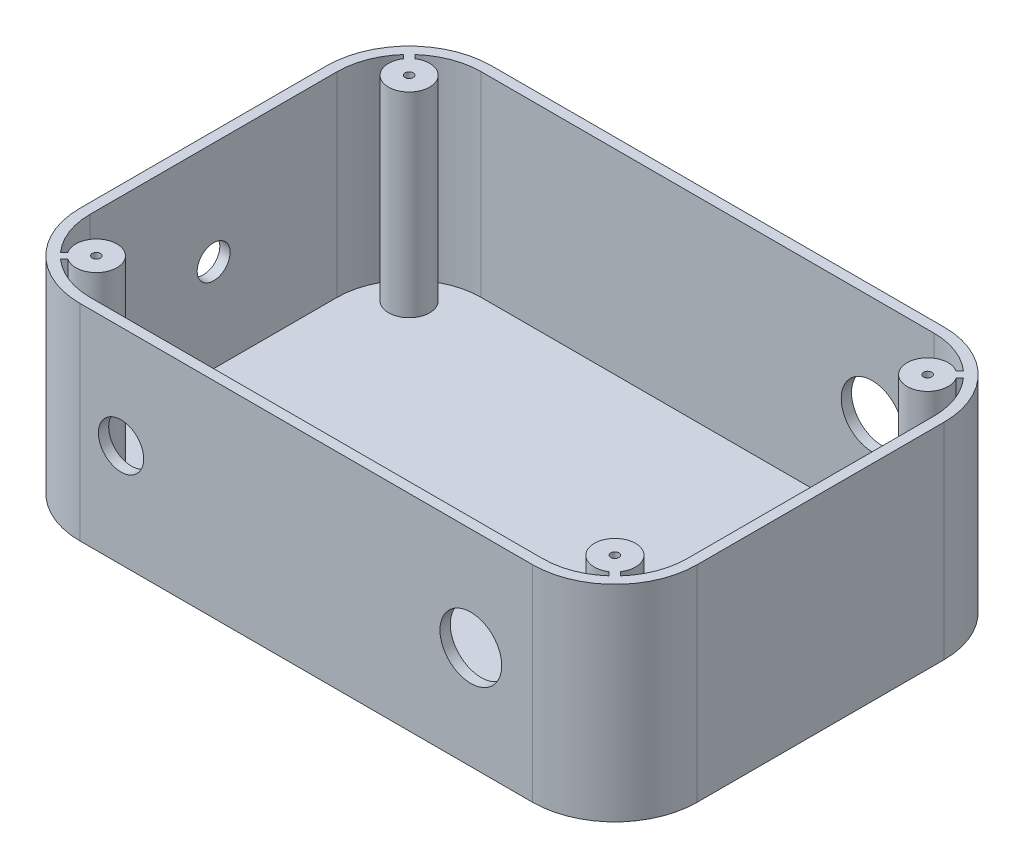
ISO-10303-21;
HEADER;
FILE_DESCRIPTION(('STEP AP214'),'2;1');
FILE_NAME('part.step','',(''),(''),'','','');
FILE_SCHEMA(('AUTOMOTIVE_DESIGN { 1 0 10303 214 1 1 1 1 }'));
ENDSEC;
DATA;
#1=APPLICATION_CONTEXT('core data for automotive mechanical design processes');
#2=APPLICATION_PROTOCOL_DEFINITION('international standard','automotive_design',2000,#1);
#3=PRODUCT_CONTEXT('',#1,'mechanical');
#4=PRODUCT('Part','Part','',(#3));
#5=PRODUCT_RELATED_PRODUCT_CATEGORY('part','',(#4));
#6=PRODUCT_DEFINITION_FORMATION('','',#4);
#7=PRODUCT_DEFINITION_CONTEXT('part definition',#1,'design');
#8=PRODUCT_DEFINITION('design','',#6,#7);
#9=PRODUCT_DEFINITION_SHAPE('','',#8);
#10=(LENGTH_UNIT() NAMED_UNIT(*) SI_UNIT(.MILLI.,.METRE.));
#11=(NAMED_UNIT(*) PLANE_ANGLE_UNIT() SI_UNIT($,.RADIAN.));
#12=(NAMED_UNIT(*) SI_UNIT($,.STERADIAN.) SOLID_ANGLE_UNIT());
#13=UNCERTAINTY_MEASURE_WITH_UNIT(LENGTH_MEASURE(1.E-05),#10,'distance_accuracy_value','');
#14=(GEOMETRIC_REPRESENTATION_CONTEXT(3) GLOBAL_UNCERTAINTY_ASSIGNED_CONTEXT((#13)) GLOBAL_UNIT_ASSIGNED_CONTEXT((#10,
#11,#12)) REPRESENTATION_CONTEXT('',''));
#15=CARTESIAN_POINT('',(0.,0.,0.));
#16=DIRECTION('',(0.,0.,1.));
#17=DIRECTION('',(1.,0.,0.));
#18=AXIS2_PLACEMENT_3D('',#15,#16,#17);
#19=CARTESIAN_POINT('',(55.,50.,30.));
#20=DIRECTION('',(0.,-1.,0.));
#21=DIRECTION('',(0.,0.,-1.));
#22=AXIS2_PLACEMENT_3D('',#19,#20,#21);
#23=CYLINDRICAL_SURFACE('',#22,17.5);
#24=DIRECTION('',(0.,-1.,0.));
#25=VECTOR('',#24,1.);
#26=CARTESIAN_POINT('',(66.6470423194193,50.,43.0612558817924));
#27=LINE('',#26,#25);
#28=CARTESIAN_POINT('',(66.6470423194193,2.5,43.0612558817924));
#29=VERTEX_POINT('',#28);
#30=CARTESIAN_POINT('',(66.6470423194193,50.,43.0612558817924));
#31=VERTEX_POINT('',#30);
#32=EDGE_CURVE('E44',#29,#31,#27,.F.);
#33=ORIENTED_EDGE('',*,*,#32,.F.);
#34=CARTESIAN_POINT('',(55.,2.5,30.));
#35=DIRECTION('',(0.,-1.,0.));
#36=DIRECTION('',(0.,0.,-1.));
#37=AXIS2_PLACEMENT_3D('',#34,#35,#36);
#38=CIRCLE('',#37,17.5);
#39=CARTESIAN_POINT('',(55.,2.5,47.5));
#40=VERTEX_POINT('',#39);
#41=EDGE_CURVE('E373',#29,#40,#38,.T.);
#42=ORIENTED_EDGE('',*,*,#41,.T.);
#43=DIRECTION('',(0.,1.,0.));
#44=VECTOR('',#43,1.);
#45=CARTESIAN_POINT('',(55.,50.,47.5));
#46=LINE('',#45,#44);
#47=CARTESIAN_POINT('',(55.,50.,47.5));
#48=VERTEX_POINT('',#47);
#49=EDGE_CURVE('E409',#40,#48,#46,.T.);
#50=ORIENTED_EDGE('',*,*,#49,.T.);
#51=CARTESIAN_POINT('',(55.,50.,30.));
#52=DIRECTION('',(0.,-1.,0.));
#53=DIRECTION('',(0.,0.,-1.));
#54=AXIS2_PLACEMENT_3D('',#51,#52,#53);
#55=CIRCLE('',#54,17.5);
#56=EDGE_CURVE('E404',#48,#31,#55,.F.);
#57=ORIENTED_EDGE('',*,*,#56,.T.);
#58=EDGE_LOOP('',(#33,#42,#50,#57));
#59=FACE_BOUND('',#58,.T.);
#60=ADVANCED_FACE('F35',(#59),#23,.F.);
#61=CARTESIAN_POINT('',(0.,2.5,0.));
#62=DIRECTION('',(0.,-1.,0.));
#63=DIRECTION('',(0.,0.,-1.));
#64=AXIS2_PLACEMENT_3D('',#61,#62,#63);
#65=PLANE('',#64);
#66=CARTESIAN_POINT('',(63.,2.5,38.));
#67=DIRECTION('',(0.,-1.,0.));
#68=DIRECTION('',(0.,0.,-1.));
#69=AXIS2_PLACEMENT_3D('',#66,#67,#68);
#70=CIRCLE('',#69,5.);
#71=CARTESIAN_POINT('',(67.1712083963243,2.5,40.7569948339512));
#72=VERTEX_POINT('',#71);
#73=CARTESIAN_POINT('',(65.7569948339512,2.5,42.1712083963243));
#74=VERTEX_POINT('',#73);
#75=EDGE_CURVE('E52',#72,#74,#70,.F.);
#76=ORIENTED_EDGE('',*,*,#75,.F.);
#77=DIRECTION('',(0.707106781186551,0.,0.707106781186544));
#78=VECTOR('',#77,1.);
#79=CARTESIAN_POINT('',(13.2071067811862,2.5,-13.2071067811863));
#80=LINE('',#79,#78);
#81=CARTESIAN_POINT('',(68.0612558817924,2.5,41.6470423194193));
#82=VERTEX_POINT('',#81);
#83=EDGE_CURVE('E273',#72,#82,#80,.T.);
#84=ORIENTED_EDGE('',*,*,#83,.T.);
#85=CARTESIAN_POINT('',(72.5,2.5,30.));
#86=VERTEX_POINT('',#85);
#87=EDGE_CURVE('E369',#86,#82,#38,.T.);
#88=ORIENTED_EDGE('',*,*,#87,.F.);
#89=DIRECTION('',(0.,0.,-1.));
#90=VECTOR('',#89,1.);
#91=CARTESIAN_POINT('',(72.5,2.5,0.));
#92=LINE('',#91,#90);
#93=CARTESIAN_POINT('',(72.5,2.5,-30.));
#94=VERTEX_POINT('',#93);
#95=EDGE_CURVE('E358',#86,#94,#92,.T.);
#96=ORIENTED_EDGE('',*,*,#95,.T.);
#97=CARTESIAN_POINT('',(55.,2.5,-30.));
#98=DIRECTION('',(0.,-1.,0.));
#99=DIRECTION('',(0.,0.,-1.));
#100=AXIS2_PLACEMENT_3D('',#97,#98,#99);
#101=CIRCLE('',#100,17.5);
#102=CARTESIAN_POINT('',(68.0612558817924,2.5,-41.6470423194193));
#103=VERTEX_POINT('',#102);
#104=EDGE_CURVE('E362',#103,#94,#101,.T.);
#105=ORIENTED_EDGE('',*,*,#104,.F.);
#106=DIRECTION('',(0.707106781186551,0.,-0.707106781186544));
#107=VECTOR('',#106,1.);
#108=CARTESIAN_POINT('',(13.2071067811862,2.5,13.2071067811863));
#109=LINE('',#108,#107);
#110=CARTESIAN_POINT('',(67.1712083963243,2.5,-40.7569948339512));
#111=VERTEX_POINT('',#110);
#112=EDGE_CURVE('E299',#111,#103,#109,.T.);
#113=ORIENTED_EDGE('',*,*,#112,.F.);
#114=CARTESIAN_POINT('',(63.,2.5,-38.));
#115=DIRECTION('',(0.,-1.,0.));
#116=DIRECTION('',(0.,0.,-1.));
#117=AXIS2_PLACEMENT_3D('',#114,#115,#116);
#118=CIRCLE('',#117,5.);
#119=CARTESIAN_POINT('',(65.7569948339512,2.5,-42.1712083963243));
#120=VERTEX_POINT('',#119);
#121=EDGE_CURVE('E302',#111,#120,#118,.T.);
#122=ORIENTED_EDGE('',*,*,#121,.T.);
#123=DIRECTION('',(0.707106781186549,0.,-0.707106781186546));
#124=VECTOR('',#123,1.);
#125=CARTESIAN_POINT('',(11.7928932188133,2.5,11.7928932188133));
#126=LINE('',#125,#124);
#127=CARTESIAN_POINT('',(66.6470423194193,2.5,-43.0612558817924));
#128=VERTEX_POINT('',#127);
#129=EDGE_CURVE('E295',#120,#128,#126,.T.);
#130=ORIENTED_EDGE('',*,*,#129,.T.);
#131=CARTESIAN_POINT('',(55.,2.5,-47.5));
#132=VERTEX_POINT('',#131);
#133=EDGE_CURVE('E391',#132,#128,#101,.T.);
#134=ORIENTED_EDGE('',*,*,#133,.F.);
#135=DIRECTION('',(-1.,0.,0.));
#136=VECTOR('',#135,1.);
#137=CARTESIAN_POINT('',(0.,2.5,-47.5));
#138=LINE('',#137,#136);
#139=CARTESIAN_POINT('',(-55.,2.5,-47.5));
#140=VERTEX_POINT('',#139);
#141=EDGE_CURVE('E366',#132,#140,#138,.T.);
#142=ORIENTED_EDGE('',*,*,#141,.T.);
#143=CARTESIAN_POINT('',(-55.,2.5,-30.));
#144=DIRECTION('',(0.,-1.,0.));
#145=DIRECTION('',(0.,0.,-1.));
#146=AXIS2_PLACEMENT_3D('',#143,#144,#145);
#147=CIRCLE('',#146,17.5);
#148=CARTESIAN_POINT('',(-66.6470423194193,2.5,-43.0612558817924));
#149=VERTEX_POINT('',#148);
#150=EDGE_CURVE('E388',#149,#140,#147,.T.);
#151=ORIENTED_EDGE('',*,*,#150,.F.);
#152=DIRECTION('',(-0.707106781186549,0.,-0.707106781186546));
#153=VECTOR('',#152,1.);
#154=CARTESIAN_POINT('',(-11.7928932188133,2.5,11.7928932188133));
#155=LINE('',#154,#153);
#156=CARTESIAN_POINT('',(-65.7569948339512,2.5,-42.1712083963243));
#157=VERTEX_POINT('',#156);
#158=EDGE_CURVE('E322',#157,#149,#155,.T.);
#159=ORIENTED_EDGE('',*,*,#158,.F.);
#160=CARTESIAN_POINT('',(-63.,2.5,-38.));
#161=DIRECTION('',(0.,-1.,0.));
#162=DIRECTION('',(0.,0.,-1.));
#163=AXIS2_PLACEMENT_3D('',#160,#161,#162);
#164=CIRCLE('',#163,5.);
#165=CARTESIAN_POINT('',(-67.1712083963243,2.5,-40.7569948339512));
#166=VERTEX_POINT('',#165);
#167=EDGE_CURVE('E329',#166,#157,#164,.F.);
#168=ORIENTED_EDGE('',*,*,#167,.F.);
#169=DIRECTION('',(-0.707106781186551,0.,-0.707106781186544));
#170=VECTOR('',#169,1.);
#171=CARTESIAN_POINT('',(-13.2071067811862,2.5,13.2071067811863));
#172=LINE('',#171,#170);
#173=CARTESIAN_POINT('',(-68.0612558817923,2.5,-41.6470423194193));
#174=VERTEX_POINT('',#173);
#175=EDGE_CURVE('E327',#166,#174,#172,.T.);
#176=ORIENTED_EDGE('',*,*,#175,.T.);
#177=CARTESIAN_POINT('',(-72.5,2.5,-30.));
#178=VERTEX_POINT('',#177);
#179=EDGE_CURVE('E385',#178,#174,#147,.T.);
#180=ORIENTED_EDGE('',*,*,#179,.F.);
#181=DIRECTION('',(0.,0.,1.));
#182=VECTOR('',#181,1.);
#183=CARTESIAN_POINT('',(-72.5,2.5,0.));
#184=LINE('',#183,#182);
#185=CARTESIAN_POINT('',(-72.5,2.5,30.));
#186=VERTEX_POINT('',#185);
#187=EDGE_CURVE('E378',#178,#186,#184,.T.);
#188=ORIENTED_EDGE('',*,*,#187,.T.);
#189=CARTESIAN_POINT('',(-55.,2.5,30.));
#190=DIRECTION('',(0.,-1.,0.));
#191=DIRECTION('',(0.,0.,-1.));
#192=AXIS2_PLACEMENT_3D('',#189,#190,#191);
#193=CIRCLE('',#192,17.5);
#194=CARTESIAN_POINT('',(-68.0612558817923,2.5,41.6470423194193));
#195=VERTEX_POINT('',#194);
#196=EDGE_CURVE('E382',#195,#186,#193,.T.);
#197=ORIENTED_EDGE('',*,*,#196,.F.);
#198=DIRECTION('',(-0.707106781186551,0.,0.707106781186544));
#199=VECTOR('',#198,1.);
#200=CARTESIAN_POINT('',(-13.2071067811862,2.5,-13.2071067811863));
#201=LINE('',#200,#199);
#202=CARTESIAN_POINT('',(-67.1712083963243,2.5,40.7569948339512));
#203=VERTEX_POINT('',#202);
#204=EDGE_CURVE('E355',#203,#195,#201,.T.);
#205=ORIENTED_EDGE('',*,*,#204,.F.);
#206=CARTESIAN_POINT('',(-63.,2.5,38.));
#207=DIRECTION('',(0.,-1.,0.));
#208=DIRECTION('',(0.,0.,-1.));
#209=AXIS2_PLACEMENT_3D('',#206,#207,#208);
#210=CIRCLE('',#209,5.);
#211=CARTESIAN_POINT('',(-65.7569948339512,2.5,42.1712083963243));
#212=VERTEX_POINT('',#211);
#213=EDGE_CURVE('E496',#203,#212,#210,.T.);
#214=ORIENTED_EDGE('',*,*,#213,.T.);
#215=DIRECTION('',(-0.707106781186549,0.,0.707106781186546));
#216=VECTOR('',#215,1.);
#217=CARTESIAN_POINT('',(-11.7928932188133,2.5,-11.7928932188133));
#218=LINE('',#217,#216);
#219=CARTESIAN_POINT('',(-66.6470423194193,2.5,43.0612558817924));
#220=VERTEX_POINT('',#219);
#221=EDGE_CURVE('E351',#212,#220,#218,.T.);
#222=ORIENTED_EDGE('',*,*,#221,.T.);
#223=CARTESIAN_POINT('',(-55.,2.5,47.5));
#224=VERTEX_POINT('',#223);
#225=EDGE_CURVE('E379',#224,#220,#193,.T.);
#226=ORIENTED_EDGE('',*,*,#225,.F.);
#227=DIRECTION('',(1.,0.,0.));
#228=VECTOR('',#227,1.);
#229=CARTESIAN_POINT('',(0.,2.5,47.5));
#230=LINE('',#229,#228);
#231=EDGE_CURVE('E374',#224,#40,#230,.T.);
#232=ORIENTED_EDGE('',*,*,#231,.T.);
#233=ORIENTED_EDGE('',*,*,#41,.F.);
#234=DIRECTION('',(0.707106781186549,0.,0.707106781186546));
#235=VECTOR('',#234,1.);
#236=CARTESIAN_POINT('',(11.7928932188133,2.5,-11.7928932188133));
#237=LINE('',#236,#235);
#238=EDGE_CURVE('E57',#74,#29,#237,.T.);
#239=ORIENTED_EDGE('',*,*,#238,.F.);
#240=EDGE_LOOP('',(#76,#84,#88,#96,#105,#113,#122,#130,#134,#142,#151,#159,#168,#176,#180,#188,
#197,#205,#214,#222,#226,#232,#233,#239));
#241=FACE_BOUND('',#240,.T.);
#242=ADVANCED_FACE('F558',(#241),#65,.F.);
#243=CARTESIAN_POINT('',(55.,50.,-30.));
#244=DIRECTION('',(0.,-1.,0.));
#245=DIRECTION('',(0.,0.,-1.));
#246=AXIS2_PLACEMENT_3D('',#243,#244,#245);
#247=CYLINDRICAL_SURFACE('',#246,17.5);
#248=DIRECTION('',(0.,-1.,0.));
#249=VECTOR('',#248,1.);
#250=CARTESIAN_POINT('',(68.0612558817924,50.,-41.6470423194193));
#251=LINE('',#250,#249);
#252=CARTESIAN_POINT('',(68.0612558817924,50.,-41.6470423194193));
#253=VERTEX_POINT('',#252);
#254=EDGE_CURVE('E507',#103,#253,#251,.F.);
#255=ORIENTED_EDGE('',*,*,#254,.F.);
#256=ORIENTED_EDGE('',*,*,#104,.T.);
#257=DIRECTION('',(0.,1.,0.));
#258=VECTOR('',#257,1.);
#259=CARTESIAN_POINT('',(72.5,50.,-30.));
#260=LINE('',#259,#258);
#261=CARTESIAN_POINT('',(72.5,50.,-30.));
#262=VERTEX_POINT('',#261);
#263=EDGE_CURVE('E363',#94,#262,#260,.T.);
#264=ORIENTED_EDGE('',*,*,#263,.T.);
#265=CARTESIAN_POINT('',(55.,50.,-30.));
#266=DIRECTION('',(0.,-1.,0.));
#267=DIRECTION('',(0.,0.,-1.));
#268=AXIS2_PLACEMENT_3D('',#265,#266,#267);
#269=CIRCLE('',#268,17.5);
#270=EDGE_CURVE('E415',#262,#253,#269,.F.);
#271=ORIENTED_EDGE('',*,*,#270,.T.);
#272=EDGE_LOOP('',(#255,#256,#264,#271));
#273=FACE_BOUND('',#272,.T.);
#274=ADVANCED_FACE('F565',(#273),#247,.F.);
#275=CARTESIAN_POINT('',(-55.,50.,-30.));
#276=DIRECTION('',(0.,-1.,0.));
#277=DIRECTION('',(0.,0.,-1.));
#278=AXIS2_PLACEMENT_3D('',#275,#276,#277);
#279=CYLINDRICAL_SURFACE('',#278,17.5);
#280=DIRECTION('',(0.,-1.,0.));
#281=VECTOR('',#280,1.);
#282=CARTESIAN_POINT('',(-66.6470423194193,50.,-43.0612558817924));
#283=LINE('',#282,#281);
#284=CARTESIAN_POINT('',(-66.6470423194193,50.,-43.0612558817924));
#285=VERTEX_POINT('',#284);
#286=EDGE_CURVE('E498',#149,#285,#283,.F.);
#287=ORIENTED_EDGE('',*,*,#286,.F.);
#288=ORIENTED_EDGE('',*,*,#150,.T.);
#289=DIRECTION('',(0.,1.,0.));
#290=VECTOR('',#289,1.);
#291=CARTESIAN_POINT('',(-55.,50.,-47.5));
#292=LINE('',#291,#290);
#293=CARTESIAN_POINT('',(-55.,50.,-47.5));
#294=VERTEX_POINT('',#293);
#295=EDGE_CURVE('E394',#140,#294,#292,.T.);
#296=ORIENTED_EDGE('',*,*,#295,.T.);
#297=CARTESIAN_POINT('',(-55.,50.,-30.));
#298=DIRECTION('',(0.,-1.,0.));
#299=DIRECTION('',(0.,0.,-1.));
#300=AXIS2_PLACEMENT_3D('',#297,#298,#299);
#301=CIRCLE('',#300,17.5);
#302=EDGE_CURVE('E421',#294,#285,#301,.F.);
#303=ORIENTED_EDGE('',*,*,#302,.T.);
#304=EDGE_LOOP('',(#287,#288,#296,#303));
#305=FACE_BOUND('',#304,.T.);
#306=ADVANCED_FACE('F691',(#305),#279,.F.);
#307=CARTESIAN_POINT('',(-55.,50.,30.));
#308=DIRECTION('',(0.,-1.,0.));
#309=DIRECTION('',(0.,0.,-1.));
#310=AXIS2_PLACEMENT_3D('',#307,#308,#309);
#311=CYLINDRICAL_SURFACE('',#310,17.5);
#312=DIRECTION('',(0.,-1.,0.));
#313=VECTOR('',#312,1.);
#314=CARTESIAN_POINT('',(-68.0612558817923,50.,41.6470423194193));
#315=LINE('',#314,#313);
#316=CARTESIAN_POINT('',(-68.0612558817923,50.,41.6470423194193));
#317=VERTEX_POINT('',#316);
#318=EDGE_CURVE('E493',#195,#317,#315,.F.);
#319=ORIENTED_EDGE('',*,*,#318,.F.);
#320=ORIENTED_EDGE('',*,*,#196,.T.);
#321=DIRECTION('',(0.,1.,0.));
#322=VECTOR('',#321,1.);
#323=CARTESIAN_POINT('',(-72.5,50.,30.));
#324=LINE('',#323,#322);
#325=CARTESIAN_POINT('',(-72.5,50.,30.));
#326=VERTEX_POINT('',#325);
#327=EDGE_CURVE('E400',#186,#326,#324,.T.);
#328=ORIENTED_EDGE('',*,*,#327,.T.);
#329=CARTESIAN_POINT('',(-55.,50.,30.));
#330=DIRECTION('',(0.,-1.,0.));
#331=DIRECTION('',(0.,0.,-1.));
#332=AXIS2_PLACEMENT_3D('',#329,#330,#331);
#333=CIRCLE('',#332,17.5);
#334=EDGE_CURVE('E425',#326,#317,#333,.F.);
#335=ORIENTED_EDGE('',*,*,#334,.T.);
#336=EDGE_LOOP('',(#319,#320,#328,#335));
#337=FACE_BOUND('',#336,.T.);
#338=ADVANCED_FACE('F578',(#337),#311,.F.);
#339=CARTESIAN_POINT('',(75.,50.,50.));
#340=DIRECTION('',(-1.,0.,0.));
#341=DIRECTION('',(0.,0.,1.));
#342=AXIS2_PLACEMENT_3D('',#339,#340,#341);
#343=PLANE('',#342);
#344=DIRECTION('',(0.,0.,-1.));
#345=VECTOR('',#344,1.);
#346=CARTESIAN_POINT('',(75.,50.,50.));
#347=LINE('',#346,#345);
#348=CARTESIAN_POINT('',(75.,50.,30.));
#349=VERTEX_POINT('',#348);
#350=CARTESIAN_POINT('',(75.,50.,-30.));
#351=VERTEX_POINT('',#350);
#352=EDGE_CURVE('E431',#349,#351,#347,.T.);
#353=ORIENTED_EDGE('',*,*,#352,.F.);
#354=DIRECTION('',(0.,-1.,0.));
#355=VECTOR('',#354,1.);
#356=CARTESIAN_POINT('',(75.,50.,30.));
#357=LINE('',#356,#355);
#358=CARTESIAN_POINT('',(75.,0.,30.));
#359=VERTEX_POINT('',#358);
#360=EDGE_CURVE('E456',#349,#359,#357,.T.);
#361=ORIENTED_EDGE('',*,*,#360,.T.);
#362=DIRECTION('',(0.,0.,-1.));
#363=VECTOR('',#362,1.);
#364=CARTESIAN_POINT('',(75.,0.,50.));
#365=LINE('',#364,#363);
#366=CARTESIAN_POINT('',(75.,0.,-30.));
#367=VERTEX_POINT('',#366);
#368=EDGE_CURVE('E396',#359,#367,#365,.T.);
#369=ORIENTED_EDGE('',*,*,#368,.T.);
#370=DIRECTION('',(0.,-1.,0.));
#371=VECTOR('',#370,1.);
#372=CARTESIAN_POINT('',(75.,50.,-30.));
#373=LINE('',#372,#371);
#374=EDGE_CURVE('E444',#367,#351,#373,.F.);
#375=ORIENTED_EDGE('',*,*,#374,.T.);
#376=EDGE_LOOP('',(#353,#361,#369,#375));
#377=FACE_BOUND('',#376,.T.);
#378=ADVANCED_FACE('F690',(#377),#343,.F.);
#379=CARTESIAN_POINT('',(-75.,50.,-50.));
#380=DIRECTION('',(0.,0.,1.));
#381=DIRECTION('',(1.,0.,0.));
#382=AXIS2_PLACEMENT_3D('',#379,#380,#381);
#383=PLANE('',#382);
#384=CARTESIAN_POINT('',(40.,25.,-50.));
#385=DIRECTION('',(0.,0.,-1.));
#386=DIRECTION('',(-1.,0.,0.));
#387=AXIS2_PLACEMENT_3D('',#384,#385,#386);
#388=CIRCLE('',#387,7.5);
#389=CARTESIAN_POINT('',(32.5,25.,-50.));
#390=VERTEX_POINT('',#389);
#391=EDGE_CURVE('E517',#390,#390,#388,.T.);
#392=ORIENTED_EDGE('',*,*,#391,.F.);
#393=EDGE_LOOP('',(#392));
#394=FACE_BOUND('',#393,.T.);
#395=DIRECTION('',(-1.,0.,0.));
#396=VECTOR('',#395,1.);
#397=CARTESIAN_POINT('',(-75.,0.,-50.));
#398=LINE('',#397,#396);
#399=CARTESIAN_POINT('',(55.,0.,-50.));
#400=VERTEX_POINT('',#399);
#401=CARTESIAN_POINT('',(-55.,0.,-50.));
#402=VERTEX_POINT('',#401);
#403=EDGE_CURVE('E447',#400,#402,#398,.T.);
#404=ORIENTED_EDGE('',*,*,#403,.T.);
#405=DIRECTION('',(0.,-1.,0.));
#406=VECTOR('',#405,1.);
#407=CARTESIAN_POINT('',(-55.,50.,-50.));
#408=LINE('',#407,#406);
#409=CARTESIAN_POINT('',(-55.,50.,-50.));
#410=VERTEX_POINT('',#409);
#411=EDGE_CURVE('E488',#402,#410,#408,.F.);
#412=ORIENTED_EDGE('',*,*,#411,.T.);
#413=DIRECTION('',(-1.,0.,0.));
#414=VECTOR('',#413,1.);
#415=CARTESIAN_POINT('',(-75.,50.,-50.));
#416=LINE('',#415,#414);
#417=CARTESIAN_POINT('',(55.,50.,-50.));
#418=VERTEX_POINT('',#417);
#419=EDGE_CURVE('E434',#418,#410,#416,.T.);
#420=ORIENTED_EDGE('',*,*,#419,.F.);
#421=DIRECTION('',(0.,-1.,0.));
#422=VECTOR('',#421,1.);
#423=CARTESIAN_POINT('',(55.,50.,-50.));
#424=LINE('',#423,#422);
#425=EDGE_CURVE('E485',#418,#400,#424,.T.);
#426=ORIENTED_EDGE('',*,*,#425,.T.);
#427=EDGE_LOOP('',(#404,#412,#420,#426));
#428=FACE_BOUND('',#427,.T.);
#429=ADVANCED_FACE('F696',(#394,#428),#383,.F.);
#430=CARTESIAN_POINT('',(-75.,50.,50.));
#431=DIRECTION('',(1.,0.,0.));
#432=DIRECTION('',(0.,0.,-1.));
#433=AXIS2_PLACEMENT_3D('',#430,#431,#432);
#434=PLANE('',#433);
#435=CARTESIAN_POINT('',(-75.,25.,0.));
#436=DIRECTION('',(-1.,0.,0.));
#437=DIRECTION('',(0.,0.,1.));
#438=AXIS2_PLACEMENT_3D('',#435,#436,#437);
#439=CIRCLE('',#438,4.);
#440=CARTESIAN_POINT('',(-75.,25.,4.00000000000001));
#441=VERTEX_POINT('',#440);
#442=EDGE_CURVE('E528',#441,#441,#439,.T.);
#443=ORIENTED_EDGE('',*,*,#442,.F.);
#444=EDGE_LOOP('',(#443));
#445=FACE_BOUND('',#444,.T.);
#446=DIRECTION('',(0.,0.,1.));
#447=VECTOR('',#446,1.);
#448=CARTESIAN_POINT('',(-75.,0.,50.));
#449=LINE('',#448,#447);
#450=CARTESIAN_POINT('',(-75.,0.,-30.));
#451=VERTEX_POINT('',#450);
#452=CARTESIAN_POINT('',(-75.,0.,30.));
#453=VERTEX_POINT('',#452);
#454=EDGE_CURVE('E450',#451,#453,#449,.T.);
#455=ORIENTED_EDGE('',*,*,#454,.T.);
#456=DIRECTION('',(0.,-1.,0.));
#457=VECTOR('',#456,1.);
#458=CARTESIAN_POINT('',(-75.,50.,30.));
#459=LINE('',#458,#457);
#460=CARTESIAN_POINT('',(-75.,50.,30.));
#461=VERTEX_POINT('',#460);
#462=EDGE_CURVE('E483',#453,#461,#459,.F.);
#463=ORIENTED_EDGE('',*,*,#462,.T.);
#464=DIRECTION('',(0.,0.,1.));
#465=VECTOR('',#464,1.);
#466=CARTESIAN_POINT('',(-75.,50.,50.));
#467=LINE('',#466,#465);
#468=CARTESIAN_POINT('',(-75.,50.,-30.));
#469=VERTEX_POINT('',#468);
#470=EDGE_CURVE('E438',#469,#461,#467,.T.);
#471=ORIENTED_EDGE('',*,*,#470,.F.);
#472=DIRECTION('',(0.,-1.,0.));
#473=VECTOR('',#472,1.);
#474=CARTESIAN_POINT('',(-75.,50.,-30.));
#475=LINE('',#474,#473);
#476=EDGE_CURVE('E480',#469,#451,#475,.T.);
#477=ORIENTED_EDGE('',*,*,#476,.T.);
#478=EDGE_LOOP('',(#455,#463,#471,#477));
#479=FACE_BOUND('',#478,.T.);
#480=ADVANCED_FACE('F716',(#445,#479),#434,.F.);
#481=CARTESIAN_POINT('',(-75.,50.,50.));
#482=DIRECTION('',(0.,0.,-1.));
#483=DIRECTION('',(-1.,0.,0.));
#484=AXIS2_PLACEMENT_3D('',#481,#482,#483);
#485=PLANE('',#484);
#486=CARTESIAN_POINT('',(-45.,25.,50.));
#487=DIRECTION('',(0.,0.,1.));
#488=DIRECTION('',(1.,0.,0.));
#489=AXIS2_PLACEMENT_3D('',#486,#487,#488);
#490=CIRCLE('',#489,5.5);
#491=CARTESIAN_POINT('',(-39.5,25.,50.));
#492=VERTEX_POINT('',#491);
#493=EDGE_CURVE('E518',#492,#492,#490,.T.);
#494=ORIENTED_EDGE('',*,*,#493,.F.);
#495=EDGE_LOOP('',(#494));
#496=FACE_BOUND('',#495,.T.);
#497=CARTESIAN_POINT('',(40.,25.,50.));
#498=DIRECTION('',(0.,0.,-1.));
#499=DIRECTION('',(-1.,0.,0.));
#500=AXIS2_PLACEMENT_3D('',#497,#498,#499);
#501=CIRCLE('',#500,7.5);
#502=CARTESIAN_POINT('',(32.5,25.,50.));
#503=VERTEX_POINT('',#502);
#504=EDGE_CURVE('E514',#503,#503,#501,.T.);
#505=ORIENTED_EDGE('',*,*,#504,.T.);
#506=EDGE_LOOP('',(#505));
#507=FACE_BOUND('',#506,.T.);
#508=DIRECTION('',(1.,0.,0.));
#509=VECTOR('',#508,1.);
#510=CARTESIAN_POINT('',(-75.,0.,50.));
#511=LINE('',#510,#509);
#512=CARTESIAN_POINT('',(-55.,0.,50.));
#513=VERTEX_POINT('',#512);
#514=CARTESIAN_POINT('',(55.,0.,50.));
#515=VERTEX_POINT('',#514);
#516=EDGE_CURVE('E435',#513,#515,#511,.T.);
#517=ORIENTED_EDGE('',*,*,#516,.T.);
#518=DIRECTION('',(0.,-1.,0.));
#519=VECTOR('',#518,1.);
#520=CARTESIAN_POINT('',(55.,50.,50.));
#521=LINE('',#520,#519);
#522=CARTESIAN_POINT('',(55.,50.,50.));
#523=VERTEX_POINT('',#522);
#524=EDGE_CURVE('E470',#515,#523,#521,.F.);
#525=ORIENTED_EDGE('',*,*,#524,.T.);
#526=DIRECTION('',(1.,0.,0.));
#527=VECTOR('',#526,1.);
#528=CARTESIAN_POINT('',(-75.,50.,50.));
#529=LINE('',#528,#527);
#530=CARTESIAN_POINT('',(-55.,50.,50.));
#531=VERTEX_POINT('',#530);
#532=EDGE_CURVE('E441',#531,#523,#529,.T.);
#533=ORIENTED_EDGE('',*,*,#532,.F.);
#534=DIRECTION('',(0.,-1.,0.));
#535=VECTOR('',#534,1.);
#536=CARTESIAN_POINT('',(-55.,50.,50.));
#537=LINE('',#536,#535);
#538=EDGE_CURVE('E467',#531,#513,#537,.T.);
#539=ORIENTED_EDGE('',*,*,#538,.T.);
#540=EDGE_LOOP('',(#517,#525,#533,#539));
#541=FACE_BOUND('',#540,.T.);
#542=ADVANCED_FACE('F709',(#496,#507,#541),#485,.F.);
#543=CARTESIAN_POINT('',(0.,50.,0.));
#544=DIRECTION('',(0.,-1.,0.));
#545=DIRECTION('',(0.,0.,-1.));
#546=AXIS2_PLACEMENT_3D('',#543,#544,#545);
#547=PLANE('',#546);
#548=CARTESIAN_POINT('',(63.,50.,38.));
#549=DIRECTION('',(0.,-1.,0.));
#550=DIRECTION('',(0.,0.,1.));
#551=AXIS2_PLACEMENT_3D('',#548,#549,#550);
#552=CIRCLE('',#551,0.999999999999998);
#553=CARTESIAN_POINT('',(63.,50.,39.));
#554=VERTEX_POINT('',#553);
#555=EDGE_CURVE('E535',#554,#554,#552,.T.);
#556=ORIENTED_EDGE('',*,*,#555,.T.);
#557=EDGE_LOOP('',(#556));
#558=FACE_BOUND('',#557,.T.);
#559=CARTESIAN_POINT('',(55.,50.,30.));
#560=DIRECTION('',(0.,-1.,0.));
#561=DIRECTION('',(0.,0.,-1.));
#562=AXIS2_PLACEMENT_3D('',#559,#560,#561);
#563=CIRCLE('',#562,20.);
#564=EDGE_CURVE('E478',#523,#349,#563,.F.);
#565=ORIENTED_EDGE('',*,*,#564,.T.);
#566=ORIENTED_EDGE('',*,*,#352,.T.);
#567=CARTESIAN_POINT('',(55.,50.,-30.));
#568=DIRECTION('',(0.,-1.,0.));
#569=DIRECTION('',(0.,0.,-1.));
#570=AXIS2_PLACEMENT_3D('',#567,#568,#569);
#571=CIRCLE('',#570,20.);
#572=EDGE_CURVE('E472',#351,#418,#571,.F.);
#573=ORIENTED_EDGE('',*,*,#572,.T.);
#574=ORIENTED_EDGE('',*,*,#419,.T.);
#575=CARTESIAN_POINT('',(-55.,50.,-30.));
#576=DIRECTION('',(0.,-1.,0.));
#577=DIRECTION('',(0.,0.,-1.));
#578=AXIS2_PLACEMENT_3D('',#575,#576,#577);
#579=CIRCLE('',#578,20.);
#580=EDGE_CURVE('E474',#410,#469,#579,.F.);
#581=ORIENTED_EDGE('',*,*,#580,.T.);
#582=ORIENTED_EDGE('',*,*,#470,.T.);
#583=CARTESIAN_POINT('',(-55.,50.,30.));
#584=DIRECTION('',(0.,-1.,0.));
#585=DIRECTION('',(0.,0.,-1.));
#586=AXIS2_PLACEMENT_3D('',#583,#584,#585);
#587=CIRCLE('',#586,20.);
#588=EDGE_CURVE('E476',#461,#531,#587,.F.);
#589=ORIENTED_EDGE('',*,*,#588,.T.);
#590=ORIENTED_EDGE('',*,*,#532,.T.);
#591=EDGE_LOOP('',(#565,#566,#573,#574,#581,#582,#589,#590));
#592=FACE_BOUND('',#591,.T.);
#593=CARTESIAN_POINT('',(63.,50.,-38.));
#594=DIRECTION('',(0.,1.,0.));
#595=DIRECTION('',(0.,0.,-1.));
#596=AXIS2_PLACEMENT_3D('',#593,#594,#595);
#597=CIRCLE('',#596,0.999999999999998);
#598=CARTESIAN_POINT('',(63.,50.,-39.));
#599=VERTEX_POINT('',#598);
#600=EDGE_CURVE('E276',#599,#599,#597,.T.);
#601=ORIENTED_EDGE('',*,*,#600,.F.);
#602=EDGE_LOOP('',(#601));
#603=FACE_BOUND('',#602,.T.);
#604=CARTESIAN_POINT('',(68.0612558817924,50.,41.6470423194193));
#605=VERTEX_POINT('',#604);
#606=CARTESIAN_POINT('',(72.5,50.,30.));
#607=VERTEX_POINT('',#606);
#608=EDGE_CURVE('E427',#605,#607,#55,.F.);
#609=ORIENTED_EDGE('',*,*,#608,.F.);
#610=DIRECTION('',(0.707106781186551,0.,0.707106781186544));
#611=VECTOR('',#610,1.);
#612=CARTESIAN_POINT('',(13.2071067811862,50.,-13.2071067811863));
#613=LINE('',#612,#611);
#614=CARTESIAN_POINT('',(67.1712083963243,50.,40.7569948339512));
#615=VERTEX_POINT('',#614);
#616=EDGE_CURVE('E254',#615,#605,#613,.T.);
#617=ORIENTED_EDGE('',*,*,#616,.F.);
#618=CARTESIAN_POINT('',(63.,50.,38.));
#619=DIRECTION('',(0.,1.,0.));
#620=DIRECTION('',(0.,0.,-1.));
#621=AXIS2_PLACEMENT_3D('',#618,#619,#620);
#622=CIRCLE('',#621,5.);
#623=CARTESIAN_POINT('',(65.7569948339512,50.,42.1712083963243));
#624=VERTEX_POINT('',#623);
#625=EDGE_CURVE('E246',#615,#624,#622,.T.);
#626=ORIENTED_EDGE('',*,*,#625,.T.);
#627=DIRECTION('',(0.707106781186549,0.,0.707106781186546));
#628=VECTOR('',#627,1.);
#629=CARTESIAN_POINT('',(11.7928932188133,50.,-11.7928932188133));
#630=LINE('',#629,#628);
#631=EDGE_CURVE('E252',#624,#31,#630,.T.);
#632=ORIENTED_EDGE('',*,*,#631,.T.);
#633=ORIENTED_EDGE('',*,*,#56,.F.);
#634=DIRECTION('',(1.,0.,0.));
#635=VECTOR('',#634,1.);
#636=CARTESIAN_POINT('',(0.,50.,47.5));
#637=LINE('',#636,#635);
#638=CARTESIAN_POINT('',(-55.,50.,47.5));
#639=VERTEX_POINT('',#638);
#640=EDGE_CURVE('E368',#639,#48,#637,.T.);
#641=ORIENTED_EDGE('',*,*,#640,.F.);
#642=CARTESIAN_POINT('',(-66.6470423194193,50.,43.0612558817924));
#643=VERTEX_POINT('',#642);
#644=EDGE_CURVE('E423',#643,#639,#333,.F.);
#645=ORIENTED_EDGE('',*,*,#644,.F.);
#646=DIRECTION('',(-0.707106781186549,0.,0.707106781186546));
#647=VECTOR('',#646,1.);
#648=CARTESIAN_POINT('',(-11.7928932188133,50.,-11.7928932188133));
#649=LINE('',#648,#647);
#650=CARTESIAN_POINT('',(-65.7569948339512,50.,42.1712083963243));
#651=VERTEX_POINT('',#650);
#652=EDGE_CURVE('E344',#651,#643,#649,.T.);
#653=ORIENTED_EDGE('',*,*,#652,.F.);
#654=CARTESIAN_POINT('',(-63.,50.,38.));
#655=DIRECTION('',(0.,-1.,0.));
#656=DIRECTION('',(0.,0.,-1.));
#657=AXIS2_PLACEMENT_3D('',#654,#655,#656);
#658=CIRCLE('',#657,5.);
#659=CARTESIAN_POINT('',(-67.1712083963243,50.,40.7569948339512));
#660=VERTEX_POINT('',#659);
#661=EDGE_CURVE('E341',#660,#651,#658,.T.);
#662=ORIENTED_EDGE('',*,*,#661,.F.);
#663=DIRECTION('',(-0.707106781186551,0.,0.707106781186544));
#664=VECTOR('',#663,1.);
#665=CARTESIAN_POINT('',(-13.2071067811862,50.,-13.2071067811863));
#666=LINE('',#665,#664);
#667=EDGE_CURVE('E336',#660,#317,#666,.T.);
#668=ORIENTED_EDGE('',*,*,#667,.T.);
#669=ORIENTED_EDGE('',*,*,#334,.F.);
#670=DIRECTION('',(0.,0.,1.));
#671=VECTOR('',#670,1.);
#672=CARTESIAN_POINT('',(-72.5,50.,0.));
#673=LINE('',#672,#671);
#674=CARTESIAN_POINT('',(-72.5,50.,-30.));
#675=VERTEX_POINT('',#674);
#676=EDGE_CURVE('E420',#675,#326,#673,.T.);
#677=ORIENTED_EDGE('',*,*,#676,.F.);
#678=CARTESIAN_POINT('',(-68.0612558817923,50.,-41.6470423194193));
#679=VERTEX_POINT('',#678);
#680=EDGE_CURVE('E417',#679,#675,#301,.F.);
#681=ORIENTED_EDGE('',*,*,#680,.F.);
#682=DIRECTION('',(-0.707106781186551,0.,-0.707106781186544));
#683=VECTOR('',#682,1.);
#684=CARTESIAN_POINT('',(-13.2071067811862,50.,13.2071067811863));
#685=LINE('',#684,#683);
#686=CARTESIAN_POINT('',(-67.1712083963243,50.,-40.7569948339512));
#687=VERTEX_POINT('',#686);
#688=EDGE_CURVE('E308',#687,#679,#685,.T.);
#689=ORIENTED_EDGE('',*,*,#688,.F.);
#690=CARTESIAN_POINT('',(-63.,50.,-38.));
#691=DIRECTION('',(0.,1.,0.));
#692=DIRECTION('',(0.,0.,1.));
#693=AXIS2_PLACEMENT_3D('',#690,#691,#692);
#694=CIRCLE('',#693,5.);
#695=CARTESIAN_POINT('',(-65.7569948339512,50.,-42.1712083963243));
#696=VERTEX_POINT('',#695);
#697=EDGE_CURVE('E316',#687,#696,#694,.T.);
#698=ORIENTED_EDGE('',*,*,#697,.T.);
#699=DIRECTION('',(-0.707106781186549,0.,-0.707106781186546));
#700=VECTOR('',#699,1.);
#701=CARTESIAN_POINT('',(-11.7928932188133,50.,11.7928932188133));
#702=LINE('',#701,#700);
#703=EDGE_CURVE('E313',#696,#285,#702,.T.);
#704=ORIENTED_EDGE('',*,*,#703,.T.);
#705=ORIENTED_EDGE('',*,*,#302,.F.);
#706=DIRECTION('',(-1.,0.,0.));
#707=VECTOR('',#706,1.);
#708=CARTESIAN_POINT('',(0.,50.,-47.5));
#709=LINE('',#708,#707);
#710=CARTESIAN_POINT('',(55.,50.,-47.5));
#711=VERTEX_POINT('',#710);
#712=EDGE_CURVE('E414',#711,#294,#709,.T.);
#713=ORIENTED_EDGE('',*,*,#712,.F.);
#714=CARTESIAN_POINT('',(66.6470423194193,50.,-43.0612558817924));
#715=VERTEX_POINT('',#714);
#716=EDGE_CURVE('E411',#715,#711,#269,.F.);
#717=ORIENTED_EDGE('',*,*,#716,.F.);
#718=DIRECTION('',(0.707106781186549,0.,-0.707106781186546));
#719=VECTOR('',#718,1.);
#720=CARTESIAN_POINT('',(11.7928932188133,50.,11.7928932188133));
#721=LINE('',#720,#719);
#722=CARTESIAN_POINT('',(65.7569948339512,50.,-42.1712083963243));
#723=VERTEX_POINT('',#722);
#724=EDGE_CURVE('E288',#723,#715,#721,.T.);
#725=ORIENTED_EDGE('',*,*,#724,.F.);
#726=CARTESIAN_POINT('',(63.,50.,-38.));
#727=DIRECTION('',(0.,-1.,0.));
#728=DIRECTION('',(0.,0.,1.));
#729=AXIS2_PLACEMENT_3D('',#726,#727,#728);
#730=CIRCLE('',#729,5.);
#731=CARTESIAN_POINT('',(67.1712083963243,50.,-40.7569948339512));
#732=VERTEX_POINT('',#731);
#733=EDGE_CURVE('E285',#732,#723,#730,.T.);
#734=ORIENTED_EDGE('',*,*,#733,.F.);
#735=DIRECTION('',(0.707106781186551,0.,-0.707106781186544));
#736=VECTOR('',#735,1.);
#737=CARTESIAN_POINT('',(13.2071067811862,50.,13.2071067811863));
#738=LINE('',#737,#736);
#739=EDGE_CURVE('E280',#732,#253,#738,.T.);
#740=ORIENTED_EDGE('',*,*,#739,.T.);
#741=ORIENTED_EDGE('',*,*,#270,.F.);
#742=DIRECTION('',(0.,0.,-1.));
#743=VECTOR('',#742,1.);
#744=CARTESIAN_POINT('',(72.5,50.,0.));
#745=LINE('',#744,#743);
#746=EDGE_CURVE('E377',#607,#262,#745,.T.);
#747=ORIENTED_EDGE('',*,*,#746,.F.);
#748=EDGE_LOOP('',(#609,#617,#626,#632,#633,#641,#645,#653,#662,#668,#669,#677,#681,#689,#698,
#704,#705,#713,#717,#725,#734,#740,#741,#747));
#749=FACE_BOUND('',#748,.T.);
#750=CARTESIAN_POINT('',(-63.,50.,38.));
#751=DIRECTION('',(0.,1.,0.));
#752=DIRECTION('',(0.,0.,1.));
#753=AXIS2_PLACEMENT_3D('',#750,#751,#752);
#754=CIRCLE('',#753,0.999999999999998);
#755=CARTESIAN_POINT('',(-63.,50.,39.));
#756=VERTEX_POINT('',#755);
#757=EDGE_CURVE('E332',#756,#756,#754,.T.);
#758=ORIENTED_EDGE('',*,*,#757,.F.);
#759=EDGE_LOOP('',(#758));
#760=FACE_BOUND('',#759,.T.);
#761=CARTESIAN_POINT('',(-63.,50.,-38.));
#762=DIRECTION('',(0.,-1.,0.));
#763=DIRECTION('',(0.,0.,-1.));
#764=AXIS2_PLACEMENT_3D('',#761,#762,#763);
#765=CIRCLE('',#764,0.999999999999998);
#766=CARTESIAN_POINT('',(-63.,50.,-39.));
#767=VERTEX_POINT('',#766);
#768=EDGE_CURVE('E304',#767,#767,#765,.T.);
#769=ORIENTED_EDGE('',*,*,#768,.T.);
#770=EDGE_LOOP('',(#769));
#771=FACE_BOUND('',#770,.T.);
#772=ADVANCED_FACE('F248',(#558,#592,#603,#749,#760,#771),#547,.F.);
#773=CARTESIAN_POINT('',(0.,0.,0.));
#774=DIRECTION('',(0.,-1.,0.));
#775=DIRECTION('',(0.,0.,-1.));
#776=AXIS2_PLACEMENT_3D('',#773,#774,#775);
#777=PLANE('',#776);
#778=CARTESIAN_POINT('',(55.,0.,30.));
#779=DIRECTION('',(0.,-1.,0.));
#780=DIRECTION('',(0.,0.,-1.));
#781=AXIS2_PLACEMENT_3D('',#778,#779,#780);
#782=CIRCLE('',#781,20.);
#783=EDGE_CURVE('E465',#359,#515,#782,.T.);
#784=ORIENTED_EDGE('',*,*,#783,.T.);
#785=ORIENTED_EDGE('',*,*,#516,.F.);
#786=CARTESIAN_POINT('',(-55.,0.,30.));
#787=DIRECTION('',(0.,-1.,0.));
#788=DIRECTION('',(0.,0.,-1.));
#789=AXIS2_PLACEMENT_3D('',#786,#787,#788);
#790=CIRCLE('',#789,20.);
#791=EDGE_CURVE('E463',#513,#453,#790,.T.);
#792=ORIENTED_EDGE('',*,*,#791,.T.);
#793=ORIENTED_EDGE('',*,*,#454,.F.);
#794=CARTESIAN_POINT('',(-55.,0.,-30.));
#795=DIRECTION('',(0.,-1.,0.));
#796=DIRECTION('',(0.,0.,-1.));
#797=AXIS2_PLACEMENT_3D('',#794,#795,#796);
#798=CIRCLE('',#797,20.);
#799=EDGE_CURVE('E461',#451,#402,#798,.T.);
#800=ORIENTED_EDGE('',*,*,#799,.T.);
#801=ORIENTED_EDGE('',*,*,#403,.F.);
#802=CARTESIAN_POINT('',(55.,0.,-30.));
#803=DIRECTION('',(0.,-1.,0.));
#804=DIRECTION('',(0.,0.,-1.));
#805=AXIS2_PLACEMENT_3D('',#802,#803,#804);
#806=CIRCLE('',#805,20.);
#807=EDGE_CURVE('E459',#400,#367,#806,.T.);
#808=ORIENTED_EDGE('',*,*,#807,.T.);
#809=ORIENTED_EDGE('',*,*,#368,.F.);
#810=EDGE_LOOP('',(#784,#785,#792,#793,#800,#801,#808,#809));
#811=FACE_BOUND('',#810,.T.);
#812=ADVANCED_FACE('F708',(#811),#777,.T.);
#813=CARTESIAN_POINT('',(55.,50.,30.));
#814=DIRECTION('',(0.,-1.,0.));
#815=DIRECTION('',(0.,0.,-1.));
#816=AXIS2_PLACEMENT_3D('',#813,#814,#815);
#817=CYLINDRICAL_SURFACE('',#816,20.);
#818=ORIENTED_EDGE('',*,*,#360,.F.);
#819=ORIENTED_EDGE('',*,*,#564,.F.);
#820=ORIENTED_EDGE('',*,*,#524,.F.);
#821=ORIENTED_EDGE('',*,*,#783,.F.);
#822=EDGE_LOOP('',(#818,#819,#820,#821));
#823=FACE_BOUND('',#822,.T.);
#824=ADVANCED_FACE('F712',(#823),#817,.T.);
#825=CARTESIAN_POINT('',(-55.,50.,30.));
#826=DIRECTION('',(0.,-1.,0.));
#827=DIRECTION('',(0.,0.,-1.));
#828=AXIS2_PLACEMENT_3D('',#825,#826,#827);
#829=CYLINDRICAL_SURFACE('',#828,20.);
#830=ORIENTED_EDGE('',*,*,#538,.F.);
#831=ORIENTED_EDGE('',*,*,#588,.F.);
#832=ORIENTED_EDGE('',*,*,#462,.F.);
#833=ORIENTED_EDGE('',*,*,#791,.F.);
#834=EDGE_LOOP('',(#830,#831,#832,#833));
#835=FACE_BOUND('',#834,.T.);
#836=ADVANCED_FACE('F726',(#835),#829,.T.);
#837=CARTESIAN_POINT('',(-55.,50.,-30.));
#838=DIRECTION('',(0.,-1.,0.));
#839=DIRECTION('',(0.,0.,-1.));
#840=AXIS2_PLACEMENT_3D('',#837,#838,#839);
#841=CYLINDRICAL_SURFACE('',#840,20.);
#842=ORIENTED_EDGE('',*,*,#476,.F.);
#843=ORIENTED_EDGE('',*,*,#580,.F.);
#844=ORIENTED_EDGE('',*,*,#411,.F.);
#845=ORIENTED_EDGE('',*,*,#799,.F.);
#846=EDGE_LOOP('',(#842,#843,#844,#845));
#847=FACE_BOUND('',#846,.T.);
#848=ADVANCED_FACE('F729',(#847),#841,.T.);
#849=CARTESIAN_POINT('',(55.,50.,-30.));
#850=DIRECTION('',(0.,-1.,0.));
#851=DIRECTION('',(0.,0.,-1.));
#852=AXIS2_PLACEMENT_3D('',#849,#850,#851);
#853=CYLINDRICAL_SURFACE('',#852,20.);
#854=ORIENTED_EDGE('',*,*,#425,.F.);
#855=ORIENTED_EDGE('',*,*,#572,.F.);
#856=ORIENTED_EDGE('',*,*,#374,.F.);
#857=ORIENTED_EDGE('',*,*,#807,.F.);
#858=EDGE_LOOP('',(#854,#855,#856,#857));
#859=FACE_BOUND('',#858,.T.);
#860=ADVANCED_FACE('F37',(#859),#853,.T.);
#861=CARTESIAN_POINT('',(72.5,50.,50.));
#862=DIRECTION('',(-1.,0.,0.));
#863=DIRECTION('',(0.,0.,1.));
#864=AXIS2_PLACEMENT_3D('',#861,#862,#863);
#865=PLANE('',#864);
#866=ORIENTED_EDGE('',*,*,#746,.T.);
#867=ORIENTED_EDGE('',*,*,#263,.F.);
#868=ORIENTED_EDGE('',*,*,#95,.F.);
#869=DIRECTION('',(0.,1.,0.));
#870=VECTOR('',#869,1.);
#871=CARTESIAN_POINT('',(72.5,50.,30.));
#872=LINE('',#871,#870);
#873=EDGE_CURVE('E359',#607,#86,#872,.F.);
#874=ORIENTED_EDGE('',*,*,#873,.F.);
#875=EDGE_LOOP('',(#866,#867,#868,#874));
#876=FACE_BOUND('',#875,.T.);
#877=ADVANCED_FACE('F653',(#876),#865,.T.);
#878=CARTESIAN_POINT('',(-75.,50.,-47.5));
#879=DIRECTION('',(0.,0.,1.));
#880=DIRECTION('',(1.,0.,0.));
#881=AXIS2_PLACEMENT_3D('',#878,#879,#880);
#882=PLANE('',#881);
#883=CARTESIAN_POINT('',(40.,25.,-47.5));
#884=DIRECTION('',(0.,0.,1.));
#885=DIRECTION('',(1.,0.,0.));
#886=AXIS2_PLACEMENT_3D('',#883,#884,#885);
#887=CIRCLE('',#886,7.5);
#888=CARTESIAN_POINT('',(47.5,25.,-47.5));
#889=VERTEX_POINT('',#888);
#890=EDGE_CURVE('E513',#889,#889,#887,.T.);
#891=ORIENTED_EDGE('',*,*,#890,.F.);
#892=EDGE_LOOP('',(#891));
#893=FACE_BOUND('',#892,.T.);
#894=ORIENTED_EDGE('',*,*,#141,.F.);
#895=DIRECTION('',(0.,1.,0.));
#896=VECTOR('',#895,1.);
#897=CARTESIAN_POINT('',(55.,50.,-47.5));
#898=LINE('',#897,#896);
#899=EDGE_CURVE('E397',#711,#132,#898,.F.);
#900=ORIENTED_EDGE('',*,*,#899,.F.);
#901=ORIENTED_EDGE('',*,*,#712,.T.);
#902=ORIENTED_EDGE('',*,*,#295,.F.);
#903=EDGE_LOOP('',(#894,#900,#901,#902));
#904=FACE_BOUND('',#903,.T.);
#905=ADVANCED_FACE('F656',(#893,#904),#882,.T.);
#906=CARTESIAN_POINT('',(-72.5,50.,50.));
#907=DIRECTION('',(1.,0.,0.));
#908=DIRECTION('',(0.,0.,-1.));
#909=AXIS2_PLACEMENT_3D('',#906,#907,#908);
#910=PLANE('',#909);
#911=CARTESIAN_POINT('',(-72.5,25.,0.));
#912=DIRECTION('',(1.,0.,0.));
#913=DIRECTION('',(0.,0.,-1.));
#914=AXIS2_PLACEMENT_3D('',#911,#912,#913);
#915=CIRCLE('',#914,4.);
#916=CARTESIAN_POINT('',(-72.5,25.,-3.99999999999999));
#917=VERTEX_POINT('',#916);
#918=EDGE_CURVE('E39',#917,#917,#915,.T.);
#919=ORIENTED_EDGE('',*,*,#918,.F.);
#920=EDGE_LOOP('',(#919));
#921=FACE_BOUND('',#920,.T.);
#922=ORIENTED_EDGE('',*,*,#187,.F.);
#923=DIRECTION('',(0.,1.,0.));
#924=VECTOR('',#923,1.);
#925=CARTESIAN_POINT('',(-72.5,50.,-30.));
#926=LINE('',#925,#924);
#927=EDGE_CURVE('E401',#675,#178,#926,.F.);
#928=ORIENTED_EDGE('',*,*,#927,.F.);
#929=ORIENTED_EDGE('',*,*,#676,.T.);
#930=ORIENTED_EDGE('',*,*,#327,.F.);
#931=EDGE_LOOP('',(#922,#928,#929,#930));
#932=FACE_BOUND('',#931,.T.);
#933=ADVANCED_FACE('F579',(#921,#932),#910,.T.);
#934=CARTESIAN_POINT('',(-75.,50.,47.5));
#935=DIRECTION('',(0.,0.,-1.));
#936=DIRECTION('',(-1.,0.,0.));
#937=AXIS2_PLACEMENT_3D('',#934,#935,#936);
#938=PLANE('',#937);
#939=CARTESIAN_POINT('',(-45.,25.,47.5));
#940=DIRECTION('',(0.,0.,-1.));
#941=DIRECTION('',(-1.,0.,0.));
#942=AXIS2_PLACEMENT_3D('',#939,#940,#941);
#943=CIRCLE('',#942,5.5);
#944=CARTESIAN_POINT('',(-50.5,25.,47.5));
#945=VERTEX_POINT('',#944);
#946=EDGE_CURVE('E515',#945,#945,#943,.T.);
#947=ORIENTED_EDGE('',*,*,#946,.F.);
#948=EDGE_LOOP('',(#947));
#949=FACE_BOUND('',#948,.T.);
#950=CARTESIAN_POINT('',(40.,25.,47.5));
#951=DIRECTION('',(0.,0.,-1.));
#952=DIRECTION('',(-1.,0.,0.));
#953=AXIS2_PLACEMENT_3D('',#950,#951,#952);
#954=CIRCLE('',#953,7.5);
#955=CARTESIAN_POINT('',(32.5,25.,47.5));
#956=VERTEX_POINT('',#955);
#957=EDGE_CURVE('E511',#956,#956,#954,.T.);
#958=ORIENTED_EDGE('',*,*,#957,.F.);
#959=EDGE_LOOP('',(#958));
#960=FACE_BOUND('',#959,.T.);
#961=ORIENTED_EDGE('',*,*,#231,.F.);
#962=DIRECTION('',(0.,1.,0.));
#963=VECTOR('',#962,1.);
#964=CARTESIAN_POINT('',(-55.,50.,47.5));
#965=LINE('',#964,#963);
#966=EDGE_CURVE('E372',#639,#224,#965,.F.);
#967=ORIENTED_EDGE('',*,*,#966,.F.);
#968=ORIENTED_EDGE('',*,*,#640,.T.);
#969=ORIENTED_EDGE('',*,*,#49,.F.);
#970=EDGE_LOOP('',(#961,#967,#968,#969));
#971=FACE_BOUND('',#970,.T.);
#972=ADVANCED_FACE('F570',(#949,#960,#971),#938,.T.);
#973=ORIENTED_EDGE('',*,*,#87,.T.);
#974=DIRECTION('',(0.,-1.,0.));
#975=VECTOR('',#974,1.);
#976=CARTESIAN_POINT('',(68.0612558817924,50.,41.6470423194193));
#977=LINE('',#976,#975);
#978=EDGE_CURVE('E11',#82,#605,#977,.F.);
#979=ORIENTED_EDGE('',*,*,#978,.T.);
#980=ORIENTED_EDGE('',*,*,#608,.T.);
#981=ORIENTED_EDGE('',*,*,#873,.T.);
#982=EDGE_LOOP('',(#973,#979,#980,#981));
#983=FACE_BOUND('',#982,.T.);
#984=ADVANCED_FACE('F561',(#983),#23,.F.);
#985=ORIENTED_EDGE('',*,*,#225,.T.);
#986=DIRECTION('',(0.,-1.,0.));
#987=VECTOR('',#986,1.);
#988=CARTESIAN_POINT('',(-66.6470423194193,50.,43.0612558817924));
#989=LINE('',#988,#987);
#990=EDGE_CURVE('E490',#220,#643,#989,.F.);
#991=ORIENTED_EDGE('',*,*,#990,.T.);
#992=ORIENTED_EDGE('',*,*,#644,.T.);
#993=ORIENTED_EDGE('',*,*,#966,.T.);
#994=EDGE_LOOP('',(#985,#991,#992,#993));
#995=FACE_BOUND('',#994,.T.);
#996=ADVANCED_FACE('F569',(#995),#311,.F.);
#997=ORIENTED_EDGE('',*,*,#179,.T.);
#998=DIRECTION('',(0.,-1.,0.));
#999=VECTOR('',#998,1.);
#1000=CARTESIAN_POINT('',(-68.0612558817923,50.,-41.6470423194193));
#1001=LINE('',#1000,#999);
#1002=EDGE_CURVE('E501',#174,#679,#1001,.F.);
#1003=ORIENTED_EDGE('',*,*,#1002,.T.);
#1004=ORIENTED_EDGE('',*,*,#680,.T.);
#1005=ORIENTED_EDGE('',*,*,#927,.T.);
#1006=EDGE_LOOP('',(#997,#1003,#1004,#1005));
#1007=FACE_BOUND('',#1006,.T.);
#1008=ADVANCED_FACE('F576',(#1007),#279,.F.);
#1009=ORIENTED_EDGE('',*,*,#133,.T.);
#1010=DIRECTION('',(0.,-1.,0.));
#1011=VECTOR('',#1010,1.);
#1012=CARTESIAN_POINT('',(66.6470423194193,50.,-43.0612558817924));
#1013=LINE('',#1012,#1011);
#1014=EDGE_CURVE('E504',#128,#715,#1013,.F.);
#1015=ORIENTED_EDGE('',*,*,#1014,.T.);
#1016=ORIENTED_EDGE('',*,*,#716,.T.);
#1017=ORIENTED_EDGE('',*,*,#899,.T.);
#1018=EDGE_LOOP('',(#1009,#1015,#1016,#1017));
#1019=FACE_BOUND('',#1018,.T.);
#1020=ADVANCED_FACE('F648',(#1019),#247,.F.);
#1021=CARTESIAN_POINT('',(-63.,50.,38.));
#1022=DIRECTION('',(0.,-1.,0.));
#1023=DIRECTION('',(0.,0.,-1.));
#1024=AXIS2_PLACEMENT_3D('',#1021,#1022,#1023);
#1025=CYLINDRICAL_SURFACE('',#1024,5.);
#1026=ORIENTED_EDGE('',*,*,#213,.F.);
#1027=DIRECTION('',(0.,-1.,0.));
#1028=VECTOR('',#1027,1.);
#1029=CARTESIAN_POINT('',(-67.1712083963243,50.,40.7569948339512));
#1030=LINE('',#1029,#1028);
#1031=EDGE_CURVE('E347',#660,#203,#1030,.T.);
#1032=ORIENTED_EDGE('',*,*,#1031,.F.);
#1033=ORIENTED_EDGE('',*,*,#661,.T.);
#1034=DIRECTION('',(0.,-1.,0.));
#1035=VECTOR('',#1034,1.);
#1036=CARTESIAN_POINT('',(-65.7569948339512,50.,42.1712083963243));
#1037=LINE('',#1036,#1035);
#1038=EDGE_CURVE('E348',#651,#212,#1037,.T.);
#1039=ORIENTED_EDGE('',*,*,#1038,.T.);
#1040=EDGE_LOOP('',(#1026,#1032,#1033,#1039));
#1041=FACE_BOUND('',#1040,.T.);
#1042=ADVANCED_FACE('F645',(#1041),#1025,.T.);
#1043=CARTESIAN_POINT('',(-13.2071067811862,50.,-13.2071067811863));
#1044=DIRECTION('',(0.707106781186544,0.,0.707106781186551));
#1045=DIRECTION('',(0.707106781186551,0.,-0.707106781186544));
#1046=AXIS2_PLACEMENT_3D('',#1043,#1044,#1045);
#1047=PLANE('',#1046);
#1048=ORIENTED_EDGE('',*,*,#1031,.T.);
#1049=ORIENTED_EDGE('',*,*,#204,.T.);
#1050=ORIENTED_EDGE('',*,*,#318,.T.);
#1051=ORIENTED_EDGE('',*,*,#667,.F.);
#1052=EDGE_LOOP('',(#1048,#1049,#1050,#1051));
#1053=FACE_BOUND('',#1052,.T.);
#1054=ADVANCED_FACE('F643',(#1053),#1047,.F.);
#1055=CARTESIAN_POINT('',(-11.7928932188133,50.,-11.7928932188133));
#1056=DIRECTION('',(0.707106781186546,0.,0.707106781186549));
#1057=DIRECTION('',(0.707106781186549,0.,-0.707106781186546));
#1058=AXIS2_PLACEMENT_3D('',#1055,#1056,#1057);
#1059=PLANE('',#1058);
#1060=ORIENTED_EDGE('',*,*,#221,.F.);
#1061=ORIENTED_EDGE('',*,*,#1038,.F.);
#1062=ORIENTED_EDGE('',*,*,#652,.T.);
#1063=ORIENTED_EDGE('',*,*,#990,.F.);
#1064=EDGE_LOOP('',(#1060,#1061,#1062,#1063));
#1065=FACE_BOUND('',#1064,.T.);
#1066=ADVANCED_FACE('F639',(#1065),#1059,.T.);
#1067=CARTESIAN_POINT('',(-63.,4.,38.));
#1068=DIRECTION('',(0.,1.,0.));
#1069=DIRECTION('',(0.,0.,1.));
#1070=AXIS2_PLACEMENT_3D('',#1067,#1068,#1069);
#1071=CYLINDRICAL_SURFACE('',#1070,0.999999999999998);
#1072=CARTESIAN_POINT('',(-63.,4.,38.));
#1073=DIRECTION('',(0.,1.,0.));
#1074=DIRECTION('',(0.,0.,1.));
#1075=AXIS2_PLACEMENT_3D('',#1072,#1073,#1074);
#1076=CIRCLE('',#1075,0.999999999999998);
#1077=CARTESIAN_POINT('',(-63.,4.,39.));
#1078=VERTEX_POINT('',#1077);
#1079=EDGE_CURVE('E333',#1078,#1078,#1076,.T.);
#1080=ORIENTED_EDGE('',*,*,#1079,.F.);
#1081=EDGE_LOOP('',(#1080));
#1082=FACE_BOUND('',#1081,.T.);
#1083=ORIENTED_EDGE('',*,*,#757,.T.);
#1084=EDGE_LOOP('',(#1083));
#1085=FACE_BOUND('',#1084,.T.);
#1086=ADVANCED_FACE('F635',(#1082,#1085),#1071,.F.);
#1087=CARTESIAN_POINT('',(-63.,4.,38.));
#1088=DIRECTION('',(0.,1.,0.));
#1089=DIRECTION('',(0.,0.,1.));
#1090=AXIS2_PLACEMENT_3D('',#1087,#1088,#1089);
#1091=PLANE('',#1090);
#1092=ORIENTED_EDGE('',*,*,#1079,.T.);
#1093=EDGE_LOOP('',(#1092));
#1094=FACE_BOUND('',#1093,.T.);
#1095=ADVANCED_FACE('F625',(#1094),#1091,.T.);
#1096=CARTESIAN_POINT('',(-63.,50.,-38.));
#1097=DIRECTION('',(0.,-1.,0.));
#1098=DIRECTION('',(0.,0.,-1.));
#1099=AXIS2_PLACEMENT_3D('',#1096,#1097,#1098);
#1100=CYLINDRICAL_SURFACE('',#1099,5.);
#1101=DIRECTION('',(0.,-1.,0.));
#1102=VECTOR('',#1101,1.);
#1103=CARTESIAN_POINT('',(-67.1712083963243,50.,-40.7569948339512));
#1104=LINE('',#1103,#1102);
#1105=EDGE_CURVE('E319',#687,#166,#1104,.T.);
#1106=ORIENTED_EDGE('',*,*,#1105,.T.);
#1107=ORIENTED_EDGE('',*,*,#167,.T.);
#1108=DIRECTION('',(0.,-1.,0.));
#1109=VECTOR('',#1108,1.);
#1110=CARTESIAN_POINT('',(-65.7569948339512,50.,-42.1712083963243));
#1111=LINE('',#1110,#1109);
#1112=EDGE_CURVE('E318',#696,#157,#1111,.T.);
#1113=ORIENTED_EDGE('',*,*,#1112,.F.);
#1114=ORIENTED_EDGE('',*,*,#697,.F.);
#1115=EDGE_LOOP('',(#1106,#1107,#1113,#1114));
#1116=FACE_BOUND('',#1115,.T.);
#1117=ADVANCED_FACE('F621',(#1116),#1100,.T.);
#1118=CARTESIAN_POINT('',(-13.2071067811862,50.,13.2071067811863));
#1119=DIRECTION('',(-0.707106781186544,0.,0.707106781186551));
#1120=DIRECTION('',(0.707106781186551,0.,0.707106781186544));
#1121=AXIS2_PLACEMENT_3D('',#1118,#1119,#1120);
#1122=PLANE('',#1121);
#1123=ORIENTED_EDGE('',*,*,#175,.F.);
#1124=ORIENTED_EDGE('',*,*,#1105,.F.);
#1125=ORIENTED_EDGE('',*,*,#688,.T.);
#1126=ORIENTED_EDGE('',*,*,#1002,.F.);
#1127=EDGE_LOOP('',(#1123,#1124,#1125,#1126));
#1128=FACE_BOUND('',#1127,.T.);
#1129=ADVANCED_FACE('F624',(#1128),#1122,.T.);
#1130=CARTESIAN_POINT('',(-11.7928932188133,50.,11.7928932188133));
#1131=DIRECTION('',(-0.707106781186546,0.,0.707106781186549));
#1132=DIRECTION('',(0.707106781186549,0.,0.707106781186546));
#1133=AXIS2_PLACEMENT_3D('',#1130,#1131,#1132);
#1134=PLANE('',#1133);
#1135=ORIENTED_EDGE('',*,*,#1112,.T.);
#1136=ORIENTED_EDGE('',*,*,#158,.T.);
#1137=ORIENTED_EDGE('',*,*,#286,.T.);
#1138=ORIENTED_EDGE('',*,*,#703,.F.);
#1139=EDGE_LOOP('',(#1135,#1136,#1137,#1138));
#1140=FACE_BOUND('',#1139,.T.);
#1141=ADVANCED_FACE('F619',(#1140),#1134,.F.);
#1142=CARTESIAN_POINT('',(-63.,4.,-38.));
#1143=DIRECTION('',(0.,1.,0.));
#1144=DIRECTION('',(0.,0.,1.));
#1145=AXIS2_PLACEMENT_3D('',#1142,#1143,#1144);
#1146=CYLINDRICAL_SURFACE('',#1145,0.999999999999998);
#1147=CARTESIAN_POINT('',(-63.,4.,-38.));
#1148=DIRECTION('',(0.,-1.,0.));
#1149=DIRECTION('',(0.,0.,-1.));
#1150=AXIS2_PLACEMENT_3D('',#1147,#1148,#1149);
#1151=CIRCLE('',#1150,0.999999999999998);
#1152=CARTESIAN_POINT('',(-63.,4.,-39.));
#1153=VERTEX_POINT('',#1152);
#1154=EDGE_CURVE('E305',#1153,#1153,#1151,.T.);
#1155=ORIENTED_EDGE('',*,*,#1154,.T.);
#1156=EDGE_LOOP('',(#1155));
#1157=FACE_BOUND('',#1156,.T.);
#1158=ORIENTED_EDGE('',*,*,#768,.F.);
#1159=EDGE_LOOP('',(#1158));
#1160=FACE_BOUND('',#1159,.T.);
#1161=ADVANCED_FACE('F615',(#1157,#1160),#1146,.F.);
#1162=CARTESIAN_POINT('',(-63.,4.,-38.));
#1163=DIRECTION('',(0.,1.,0.));
#1164=DIRECTION('',(0.,0.,-1.));
#1165=AXIS2_PLACEMENT_3D('',#1162,#1163,#1164);
#1166=PLANE('',#1165);
#1167=ORIENTED_EDGE('',*,*,#1154,.F.);
#1168=EDGE_LOOP('',(#1167));
#1169=FACE_BOUND('',#1168,.T.);
#1170=ADVANCED_FACE('F608',(#1169),#1166,.T.);
#1171=CARTESIAN_POINT('',(63.,50.,-38.));
#1172=DIRECTION('',(0.,-1.,0.));
#1173=DIRECTION('',(0.,0.,-1.));
#1174=AXIS2_PLACEMENT_3D('',#1171,#1172,#1173);
#1175=CYLINDRICAL_SURFACE('',#1174,5.);
#1176=ORIENTED_EDGE('',*,*,#121,.F.);
#1177=DIRECTION('',(0.,-1.,0.));
#1178=VECTOR('',#1177,1.);
#1179=CARTESIAN_POINT('',(67.1712083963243,50.,-40.7569948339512));
#1180=LINE('',#1179,#1178);
#1181=EDGE_CURVE('E291',#732,#111,#1180,.T.);
#1182=ORIENTED_EDGE('',*,*,#1181,.F.);
#1183=ORIENTED_EDGE('',*,*,#733,.T.);
#1184=DIRECTION('',(0.,-1.,0.));
#1185=VECTOR('',#1184,1.);
#1186=CARTESIAN_POINT('',(65.7569948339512,50.,-42.1712083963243));
#1187=LINE('',#1186,#1185);
#1188=EDGE_CURVE('E292',#723,#120,#1187,.T.);
#1189=ORIENTED_EDGE('',*,*,#1188,.T.);
#1190=EDGE_LOOP('',(#1176,#1182,#1183,#1189));
#1191=FACE_BOUND('',#1190,.T.);
#1192=ADVANCED_FACE('F605',(#1191),#1175,.T.);
#1193=CARTESIAN_POINT('',(13.2071067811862,50.,13.2071067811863));
#1194=DIRECTION('',(-0.707106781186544,0.,-0.707106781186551));
#1195=DIRECTION('',(-0.707106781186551,0.,0.707106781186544));
#1196=AXIS2_PLACEMENT_3D('',#1193,#1194,#1195);
#1197=PLANE('',#1196);
#1198=ORIENTED_EDGE('',*,*,#1181,.T.);
#1199=ORIENTED_EDGE('',*,*,#112,.T.);
#1200=ORIENTED_EDGE('',*,*,#254,.T.);
#1201=ORIENTED_EDGE('',*,*,#739,.F.);
#1202=EDGE_LOOP('',(#1198,#1199,#1200,#1201));
#1203=FACE_BOUND('',#1202,.T.);
#1204=ADVANCED_FACE('F603',(#1203),#1197,.F.);
#1205=CARTESIAN_POINT('',(11.7928932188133,50.,11.7928932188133));
#1206=DIRECTION('',(-0.707106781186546,0.,-0.707106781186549));
#1207=DIRECTION('',(-0.707106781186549,0.,0.707106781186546));
#1208=AXIS2_PLACEMENT_3D('',#1205,#1206,#1207);
#1209=PLANE('',#1208);
#1210=ORIENTED_EDGE('',*,*,#129,.F.);
#1211=ORIENTED_EDGE('',*,*,#1188,.F.);
#1212=ORIENTED_EDGE('',*,*,#724,.T.);
#1213=ORIENTED_EDGE('',*,*,#1014,.F.);
#1214=EDGE_LOOP('',(#1210,#1211,#1212,#1213));
#1215=FACE_BOUND('',#1214,.T.);
#1216=ADVANCED_FACE('F599',(#1215),#1209,.T.);
#1217=CARTESIAN_POINT('',(63.,4.,-38.));
#1218=DIRECTION('',(0.,1.,0.));
#1219=DIRECTION('',(0.,0.,1.));
#1220=AXIS2_PLACEMENT_3D('',#1217,#1218,#1219);
#1221=CYLINDRICAL_SURFACE('',#1220,0.999999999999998);
#1222=CARTESIAN_POINT('',(63.,4.,-38.));
#1223=DIRECTION('',(0.,1.,0.));
#1224=DIRECTION('',(0.,0.,-1.));
#1225=AXIS2_PLACEMENT_3D('',#1222,#1223,#1224);
#1226=CIRCLE('',#1225,0.999999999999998);
#1227=CARTESIAN_POINT('',(63.,4.,-39.));
#1228=VERTEX_POINT('',#1227);
#1229=EDGE_CURVE('E277',#1228,#1228,#1226,.T.);
#1230=ORIENTED_EDGE('',*,*,#1229,.F.);
#1231=EDGE_LOOP('',(#1230));
#1232=FACE_BOUND('',#1231,.T.);
#1233=ORIENTED_EDGE('',*,*,#600,.T.);
#1234=EDGE_LOOP('',(#1233));
#1235=FACE_BOUND('',#1234,.T.);
#1236=ADVANCED_FACE('F595',(#1232,#1235),#1221,.F.);
#1237=CARTESIAN_POINT('',(63.,4.,-38.));
#1238=DIRECTION('',(0.,1.,0.));
#1239=DIRECTION('',(0.,0.,-1.));
#1240=AXIS2_PLACEMENT_3D('',#1237,#1238,#1239);
#1241=PLANE('',#1240);
#1242=ORIENTED_EDGE('',*,*,#1229,.T.);
#1243=EDGE_LOOP('',(#1242));
#1244=FACE_BOUND('',#1243,.T.);
#1245=ADVANCED_FACE('F591',(#1244),#1241,.T.);
#1246=CARTESIAN_POINT('',(63.,50.,38.));
#1247=DIRECTION('',(0.,-1.,0.));
#1248=DIRECTION('',(0.,0.,-1.));
#1249=AXIS2_PLACEMENT_3D('',#1246,#1247,#1248);
#1250=CYLINDRICAL_SURFACE('',#1249,5.);
#1251=DIRECTION('',(0.,-1.,0.));
#1252=VECTOR('',#1251,1.);
#1253=CARTESIAN_POINT('',(67.1712083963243,50.,40.7569948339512));
#1254=LINE('',#1253,#1252);
#1255=EDGE_CURVE('E262',#615,#72,#1254,.T.);
#1256=ORIENTED_EDGE('',*,*,#1255,.T.);
#1257=ORIENTED_EDGE('',*,*,#75,.T.);
#1258=DIRECTION('',(0.,-1.,0.));
#1259=VECTOR('',#1258,1.);
#1260=CARTESIAN_POINT('',(65.7569948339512,50.,42.1712083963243));
#1261=LINE('',#1260,#1259);
#1262=EDGE_CURVE('E257',#624,#74,#1261,.T.);
#1263=ORIENTED_EDGE('',*,*,#1262,.F.);
#1264=ORIENTED_EDGE('',*,*,#625,.F.);
#1265=EDGE_LOOP('',(#1256,#1257,#1263,#1264));
#1266=FACE_BOUND('',#1265,.T.);
#1267=ADVANCED_FACE('F260',(#1266),#1250,.T.);
#1268=CARTESIAN_POINT('',(13.2071067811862,50.,-13.2071067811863));
#1269=DIRECTION('',(0.707106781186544,0.,-0.707106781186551));
#1270=DIRECTION('',(-0.707106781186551,0.,-0.707106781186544));
#1271=AXIS2_PLACEMENT_3D('',#1268,#1269,#1270);
#1272=PLANE('',#1271);
#1273=ORIENTED_EDGE('',*,*,#83,.F.);
#1274=ORIENTED_EDGE('',*,*,#1255,.F.);
#1275=ORIENTED_EDGE('',*,*,#616,.T.);
#1276=ORIENTED_EDGE('',*,*,#978,.F.);
#1277=EDGE_LOOP('',(#1273,#1274,#1275,#1276));
#1278=FACE_BOUND('',#1277,.T.);
#1279=ADVANCED_FACE('F554',(#1278),#1272,.T.);
#1280=CARTESIAN_POINT('',(11.7928932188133,50.,-11.7928932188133));
#1281=DIRECTION('',(0.707106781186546,0.,-0.707106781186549));
#1282=DIRECTION('',(-0.707106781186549,0.,-0.707106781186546));
#1283=AXIS2_PLACEMENT_3D('',#1280,#1281,#1282);
#1284=PLANE('',#1283);
#1285=ORIENTED_EDGE('',*,*,#1262,.T.);
#1286=ORIENTED_EDGE('',*,*,#238,.T.);
#1287=ORIENTED_EDGE('',*,*,#32,.T.);
#1288=ORIENTED_EDGE('',*,*,#631,.F.);
#1289=EDGE_LOOP('',(#1285,#1286,#1287,#1288));
#1290=FACE_BOUND('',#1289,.T.);
#1291=ADVANCED_FACE('F265',(#1290),#1284,.F.);
#1292=CARTESIAN_POINT('',(63.,4.,38.));
#1293=DIRECTION('',(0.,1.,0.));
#1294=DIRECTION('',(0.,0.,1.));
#1295=AXIS2_PLACEMENT_3D('',#1292,#1293,#1294);
#1296=CYLINDRICAL_SURFACE('',#1295,0.999999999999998);
#1297=CARTESIAN_POINT('',(63.,4.,38.));
#1298=DIRECTION('',(0.,-1.,0.));
#1299=DIRECTION('',(0.,0.,1.));
#1300=AXIS2_PLACEMENT_3D('',#1297,#1298,#1299);
#1301=CIRCLE('',#1300,0.999999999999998);
#1302=CARTESIAN_POINT('',(63.,4.,39.));
#1303=VERTEX_POINT('',#1302);
#1304=EDGE_CURVE('E267',#1303,#1303,#1301,.T.);
#1305=ORIENTED_EDGE('',*,*,#1304,.T.);
#1306=EDGE_LOOP('',(#1305));
#1307=FACE_BOUND('',#1306,.T.);
#1308=ORIENTED_EDGE('',*,*,#555,.F.);
#1309=EDGE_LOOP('',(#1308));
#1310=FACE_BOUND('',#1309,.T.);
#1311=ADVANCED_FACE('F542',(#1307,#1310),#1296,.F.);
#1312=CARTESIAN_POINT('',(63.,4.,38.));
#1313=DIRECTION('',(0.,1.,0.));
#1314=DIRECTION('',(0.,0.,1.));
#1315=AXIS2_PLACEMENT_3D('',#1312,#1313,#1314);
#1316=PLANE('',#1315);
#1317=ORIENTED_EDGE('',*,*,#1304,.F.);
#1318=EDGE_LOOP('',(#1317));
#1319=FACE_BOUND('',#1318,.T.);
#1320=ADVANCED_FACE('F544',(#1319),#1316,.T.);
#1321=CARTESIAN_POINT('',(40.,25.,50.));
#1322=DIRECTION('',(0.,0.,-1.));
#1323=DIRECTION('',(-1.,0.,0.));
#1324=AXIS2_PLACEMENT_3D('',#1321,#1322,#1323);
#1325=CYLINDRICAL_SURFACE('',#1324,7.5);
#1326=ORIENTED_EDGE('',*,*,#957,.T.);
#1327=EDGE_LOOP('',(#1326));
#1328=FACE_BOUND('',#1327,.T.);
#1329=ORIENTED_EDGE('',*,*,#504,.F.);
#1330=EDGE_LOOP('',(#1329));
#1331=FACE_BOUND('',#1330,.T.);
#1332=ADVANCED_FACE('F551',(#1328,#1331),#1325,.F.);
#1333=ORIENTED_EDGE('',*,*,#890,.T.);
#1334=EDGE_LOOP('',(#1333));
#1335=FACE_BOUND('',#1334,.T.);
#1336=ORIENTED_EDGE('',*,*,#391,.T.);
#1337=EDGE_LOOP('',(#1336));
#1338=FACE_BOUND('',#1337,.T.);
#1339=ADVANCED_FACE('F789',(#1335,#1338),#1325,.F.);
#1340=CARTESIAN_POINT('',(-45.,25.,4.00000000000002));
#1341=DIRECTION('',(0.,0.,1.));
#1342=DIRECTION('',(1.,0.,0.));
#1343=AXIS2_PLACEMENT_3D('',#1340,#1341,#1342);
#1344=CYLINDRICAL_SURFACE('',#1343,5.5);
#1345=ORIENTED_EDGE('',*,*,#946,.T.);
#1346=EDGE_LOOP('',(#1345));
#1347=FACE_BOUND('',#1346,.T.);
#1348=ORIENTED_EDGE('',*,*,#493,.T.);
#1349=EDGE_LOOP('',(#1348));
#1350=FACE_BOUND('',#1349,.T.);
#1351=ADVANCED_FACE('F800',(#1347,#1350),#1344,.F.);
#1352=CARTESIAN_POINT('',(-29.,25.,0.));
#1353=DIRECTION('',(-1.,0.,0.));
#1354=DIRECTION('',(0.,0.,1.));
#1355=AXIS2_PLACEMENT_3D('',#1352,#1353,#1354);
#1356=CYLINDRICAL_SURFACE('',#1355,4.);
#1357=ORIENTED_EDGE('',*,*,#918,.T.);
#1358=EDGE_LOOP('',(#1357));
#1359=FACE_BOUND('',#1358,.T.);
#1360=ORIENTED_EDGE('',*,*,#442,.T.);
#1361=EDGE_LOOP('',(#1360));
#1362=FACE_BOUND('',#1361,.T.);
#1363=ADVANCED_FACE('F824',(#1359,#1362),#1356,.F.);
#1364=CLOSED_SHELL('',(#60,#242,#274,#306,#338,#378,#429,#480,#542,#772,#812,#824,#836,#848,
#860,#877,#905,#933,#972,#984,#996,#1008,#1020,#1042,#1054,#1066,#1086,#1095,#1117,#1129,#1141,
#1161,#1170,#1192,#1204,#1216,#1236,#1245,#1267,#1279,#1291,#1311,#1320,#1332,#1339,#1351,#1363));
#1365=MANIFOLD_SOLID_BREP('B2',#1364);
#1366=ADVANCED_BREP_SHAPE_REPRESENTATION('',(#18,#1365),#14);
#1367=SHAPE_DEFINITION_REPRESENTATION(#9,#1366);
ENDSEC;
END-ISO-10303-21;
